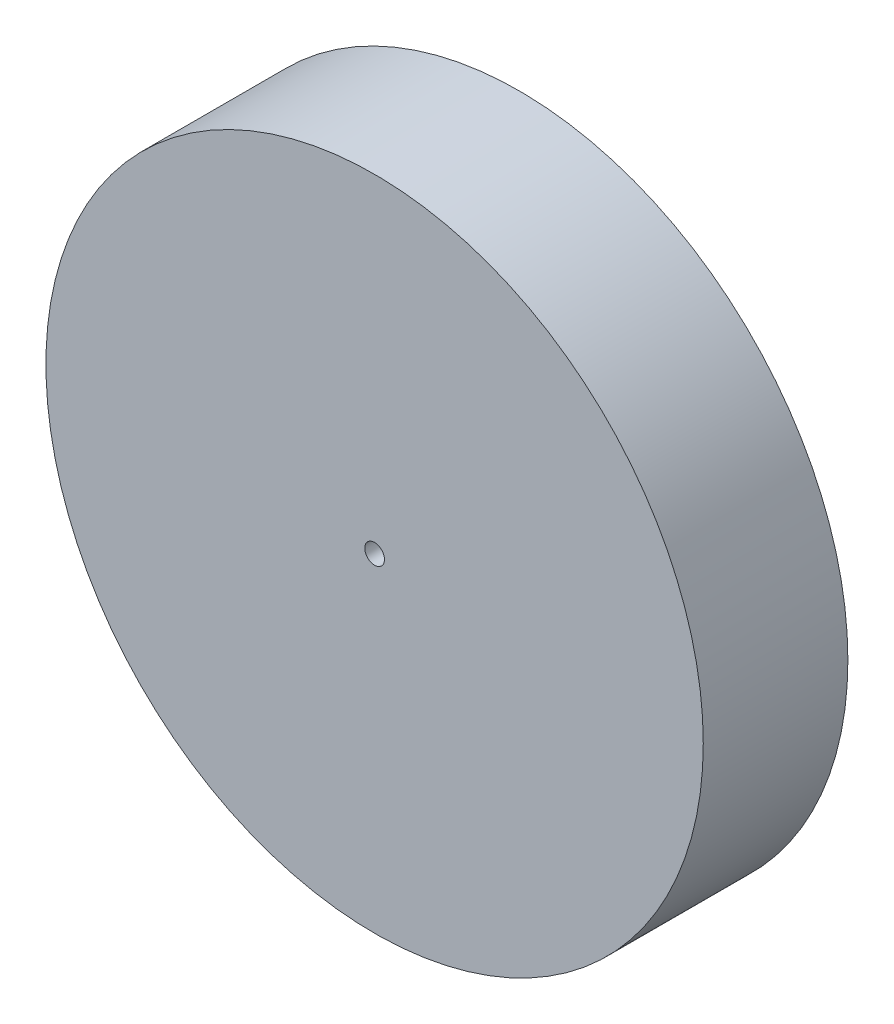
from build123d import *

# Parameters (mm, degrees)
SKETCH1_R           = 50.8
BOSS_EXTRUDE1_DEPTH = 22.352
SKETCH2_R           = 1.524
CUT_EXTRUDE1_DEPTH  = 22.352


with BuildPart() as part:
    # Sketch1 → Boss-Extrude1 (new body)
    with BuildSketch(Plane.XY):
        Circle(SKETCH1_R)
    extrude(amount=BOSS_EXTRUDE1_DEPTH)

    # Sketch2 → Cut-Extrude1 (cut)
    with BuildSketch(Plane.XY.offset(22.352)):
        Circle(SKETCH2_R)
    extrude(amount=-CUT_EXTRUDE1_DEPTH, mode=Mode.SUBTRACT)


solid = part.part
